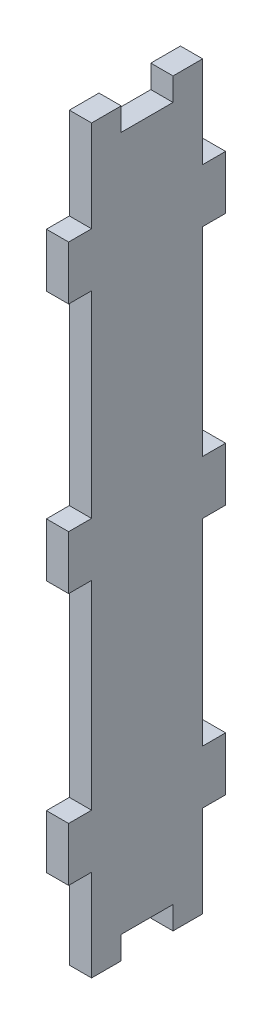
from build123d import *

# Parameters (mm, degrees)
SKETCH1_W           = 30
SKETCH1_H           = 200
BOSS_EXTRUDE1_DEPTH = 6
SKETCH2_W           = 6.2
SKETCH2_H           = 14.5
BOSS_EXTRUDE2_DEPTH = 6
SKETCH3_W           = 14
SKETCH3_H           = 6.2
CUT_EXTRUDE1_DEPTH  = 6


with BuildPart() as part:
    # Sketch1 → Boss-Extrude1 (new body)
    with BuildSketch(Plane(origin=(0, 0, 0), x_dir=(0, 0, -1), z_dir=(1, 0, 0))):
        Rectangle(SKETCH1_W, SKETCH1_H)
    extrude(amount=BOSS_EXTRUDE1_DEPTH)

    # Sketch2 → Boss-Extrude2 (add)
    with BuildSketch(Plane(origin=(6, 0, 0), x_dir=(0, 0, -1), z_dir=(1, 0, 0))):
        with Locations((-18.1, 68)):
            Rectangle(SKETCH2_W, SKETCH2_H)
        with Locations((-18.1, 0.25)):
            Rectangle(SKETCH2_W, SKETCH2_H)
        with Locations((-18.1, -68)):
            Rectangle(SKETCH2_W, SKETCH2_H)
        with Locations((18.1, -68)):
            Rectangle(SKETCH2_W, SKETCH2_H)
        with Locations((18.1, -0.25)):
            Rectangle(SKETCH2_W, SKETCH2_H)
        with Locations((18.1, 68)):
            Rectangle(SKETCH2_W, SKETCH2_H)
    extrude(amount=-BOSS_EXTRUDE2_DEPTH)

    # Sketch3 → Cut-Extrude1 (cut)
    with BuildSketch(Plane(origin=(6, 0, 0), x_dir=(0, 0, -1), z_dir=(1, 0, 0))):
        with Locations((0, 96.9)):
            Rectangle(SKETCH3_W, SKETCH3_H)
        with Locations((0, -96.9)):
            Rectangle(SKETCH3_W, SKETCH3_H)
    extrude(amount=-CUT_EXTRUDE1_DEPTH, mode=Mode.SUBTRACT)


solid = part.part
